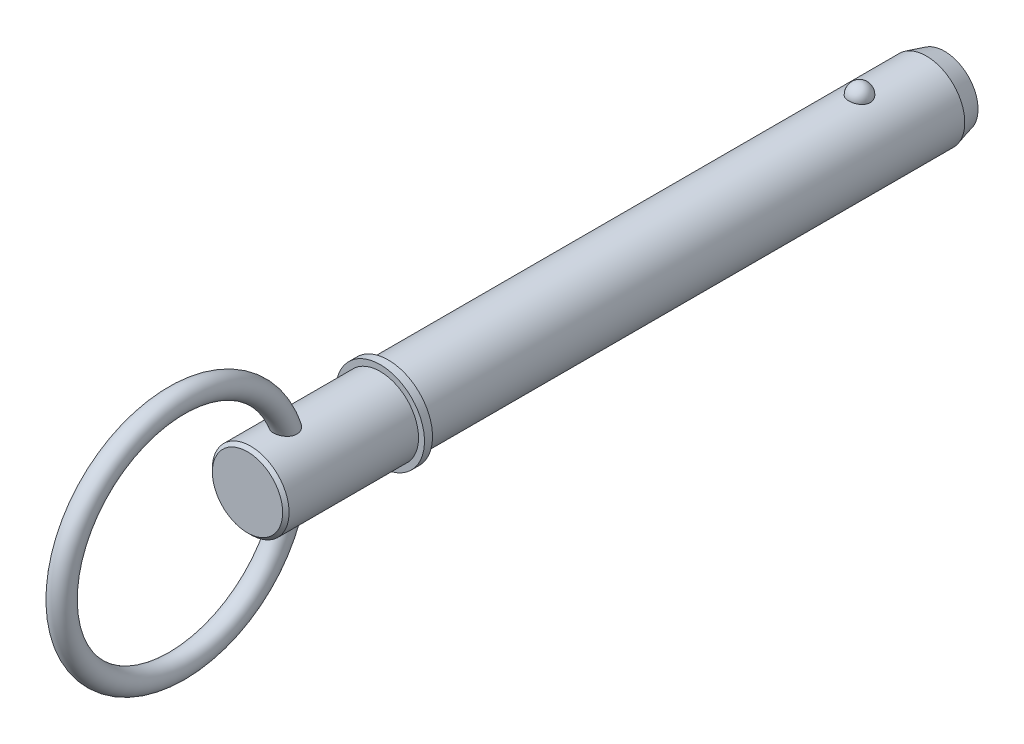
ISO-10303-21;
HEADER;
FILE_DESCRIPTION(('STEP AP214'),'2;1');
FILE_NAME('part.step','',(''),(''),'','','');
FILE_SCHEMA(('AUTOMOTIVE_DESIGN { 1 0 10303 214 1 1 1 1 }'));
ENDSEC;
DATA;
#1=APPLICATION_CONTEXT('core data for automotive mechanical design processes');
#2=APPLICATION_PROTOCOL_DEFINITION('international standard','automotive_design',2000,#1);
#3=PRODUCT_CONTEXT('',#1,'mechanical');
#4=PRODUCT('Part','Part','',(#3));
#5=PRODUCT_RELATED_PRODUCT_CATEGORY('part','',(#4));
#6=PRODUCT_DEFINITION_FORMATION('','',#4);
#7=PRODUCT_DEFINITION_CONTEXT('part definition',#1,'design');
#8=PRODUCT_DEFINITION('design','',#6,#7);
#9=PRODUCT_DEFINITION_SHAPE('','',#8);
#10=(LENGTH_UNIT() NAMED_UNIT(*) SI_UNIT(.MILLI.,.METRE.));
#11=(NAMED_UNIT(*) PLANE_ANGLE_UNIT() SI_UNIT($,.RADIAN.));
#12=(NAMED_UNIT(*) SI_UNIT($,.STERADIAN.) SOLID_ANGLE_UNIT());
#13=UNCERTAINTY_MEASURE_WITH_UNIT(LENGTH_MEASURE(1.E-05),#10,'distance_accuracy_value','');
#14=(GEOMETRIC_REPRESENTATION_CONTEXT(3) GLOBAL_UNCERTAINTY_ASSIGNED_CONTEXT((#13)) GLOBAL_UNIT_ASSIGNED_CONTEXT((#10,
#11,#12)) REPRESENTATION_CONTEXT('',''));
#15=CARTESIAN_POINT('',(0.,0.,0.));
#16=DIRECTION('',(0.,0.,1.));
#17=DIRECTION('',(1.,0.,0.));
#18=AXIS2_PLACEMENT_3D('',#15,#16,#17);
#19=CARTESIAN_POINT('',(0.,0.,114.3));
#20=DIRECTION('',(0.,0.,-1.));
#21=DIRECTION('',(-1.,0.,0.));
#22=AXIS2_PLACEMENT_3D('',#19,#20,#21);
#23=CYLINDRICAL_SURFACE('',#22,9.525);
#24=CARTESIAN_POINT('',(2.66304631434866,9.14515223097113,-2.68999999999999));
#25=CARTESIAN_POINT('',(2.66304388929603,9.14515434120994,-2.53964785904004));
#26=CARTESIAN_POINT('',(2.65079171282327,9.14874785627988,-2.38926509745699));
#27=CARTESIAN_POINT('',(2.60207590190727,9.16272073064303,-2.09276319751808));
#28=CARTESIAN_POINT('',(2.5656035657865,9.17310252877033,-1.94664561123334));
#29=CARTESIAN_POINT('',(2.469373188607,9.19947238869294,-1.66290124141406));
#30=CARTESIAN_POINT('',(2.40962536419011,9.215457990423,-1.52527076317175));
#31=CARTESIAN_POINT('',(2.26832639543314,9.25124900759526,-1.26225231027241));
#32=CARTESIAN_POINT('',(2.1867756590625,9.27105435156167,-1.13686410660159));
#33=CARTESIAN_POINT('',(2.00344089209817,9.3123948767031,-0.901158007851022));
#34=CARTESIAN_POINT('',(1.90155748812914,9.33393823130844,-0.790918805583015));
#35=CARTESIAN_POINT('',(1.68043702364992,9.37626794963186,-0.589299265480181));
#36=CARTESIAN_POINT('',(1.56119995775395,9.397054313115,-0.497918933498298));
#37=CARTESIAN_POINT('',(1.30893044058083,9.43549335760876,-0.336812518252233));
#38=CARTESIAN_POINT('',(1.17593917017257,9.45315498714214,-0.267024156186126));
#39=CARTESIAN_POINT('',(0.8995966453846,9.48344056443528,-0.150749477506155));
#40=CARTESIAN_POINT('',(0.756246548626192,9.49606507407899,-0.104260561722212));
#41=CARTESIAN_POINT('',(0.466048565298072,9.51468193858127,-0.0365733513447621));
#42=CARTESIAN_POINT('',(0.319312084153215,9.52079100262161,-0.014929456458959));
#43=CARTESIAN_POINT('',(0.0241592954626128,9.52611235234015,0.00395337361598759));
#44=CARTESIAN_POINT('',(-0.124256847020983,9.5253253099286,0.00119468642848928));
#45=CARTESIAN_POINT('',(-0.41628168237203,9.51700443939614,-0.0284230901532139));
#46=CARTESIAN_POINT('',(-0.559928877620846,9.50956858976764,-0.0549321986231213));
#47=CARTESIAN_POINT('',(-0.840604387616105,9.48887888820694,-0.130816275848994));
#48=CARTESIAN_POINT('',(-0.977632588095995,9.47562493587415,-0.180191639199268));
#49=CARTESIAN_POINT('',(-1.24212223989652,9.44460733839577,-0.300803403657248));
#50=CARTESIAN_POINT('',(-1.36952298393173,9.42681774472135,-0.372166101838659));
#51=CARTESIAN_POINT('',(-1.61053183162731,9.38864858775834,-0.534729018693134));
#52=CARTESIAN_POINT('',(-1.72413851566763,9.36826875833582,-0.625931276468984));
#53=CARTESIAN_POINT('',(-1.9367483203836,9.32666137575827,-0.827716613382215));
#54=CARTESIAN_POINT('',(-2.03542624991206,9.3054250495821,-0.938640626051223));
#55=CARTESIAN_POINT('',(-2.21301001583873,9.26480083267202,-1.17562728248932));
#56=CARTESIAN_POINT('',(-2.29191442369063,9.24541307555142,-1.3016910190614));
#57=CARTESIAN_POINT('',(-2.4288038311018,9.21040769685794,-1.56709947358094));
#58=CARTESIAN_POINT('',(-2.48653332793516,9.19483682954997,-1.70658229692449));
#59=CARTESIAN_POINT('',(-2.57830950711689,9.16952722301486,-1.99363485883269));
#60=CARTESIAN_POINT('',(-2.61235688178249,9.1597883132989,-2.14120436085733));
#61=CARTESIAN_POINT('',(-2.65582131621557,9.14728131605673,-2.43957517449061));
#62=CARTESIAN_POINT('',(-2.66534248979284,9.14448376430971,-2.59036007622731));
#63=CARTESIAN_POINT('',(-2.659816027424,9.1460926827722,-2.89143694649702));
#64=CARTESIAN_POINT('',(-2.64476907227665,9.15049895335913,-3.04172892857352));
#65=CARTESIAN_POINT('',(-2.59062526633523,9.16597303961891,-3.3367616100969));
#66=CARTESIAN_POINT('',(-2.55165119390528,9.17700684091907,-3.48152666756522));
#67=CARTESIAN_POINT('',(-2.45072334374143,9.20447158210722,-3.7622672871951));
#68=CARTESIAN_POINT('',(-2.38876863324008,9.22090274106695,-3.89824249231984));
#69=CARTESIAN_POINT('',(-2.24300082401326,9.25744165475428,-4.15838266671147));
#70=CARTESIAN_POINT('',(-2.15906901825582,9.27756919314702,-4.28247834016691));
#71=CARTESIAN_POINT('',(-1.97161008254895,9.31920445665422,-4.51460755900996));
#72=CARTESIAN_POINT('',(-1.86808218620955,9.34071223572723,-4.62264047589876));
#73=CARTESIAN_POINT('',(-1.64365852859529,9.38280712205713,-4.82005417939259));
#74=CARTESIAN_POINT('',(-1.52269814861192,9.40339041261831,-4.90936239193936));
#75=CARTESIAN_POINT('',(-1.26696810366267,9.44124442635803,-5.06628635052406));
#76=CARTESIAN_POINT('',(-1.13219941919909,9.45851538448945,-5.13390363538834));
#77=CARTESIAN_POINT('',(-0.854427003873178,9.48761400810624,-5.24478918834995));
#78=CARTESIAN_POINT('',(-0.711548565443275,9.49950757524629,-5.28835378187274));
#79=CARTESIAN_POINT('',(-0.420167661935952,9.51684639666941,-5.35116010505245));
#80=CARTESIAN_POINT('',(-0.271665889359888,9.52229244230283,-5.3704048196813));
#81=CARTESIAN_POINT('',(0.0236961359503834,9.52609381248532,-5.38387805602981));
#82=CARTESIAN_POINT('',(0.170533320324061,9.52458300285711,-5.37857884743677));
#83=CARTESIAN_POINT('',(0.461166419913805,9.51494050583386,-5.34419624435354));
#84=CARTESIAN_POINT('',(0.604962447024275,9.50680906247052,-5.31511372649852));
#85=CARTESIAN_POINT('',(0.884899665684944,9.48484202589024,-5.23415185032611));
#86=CARTESIAN_POINT('',(1.02106863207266,9.47102889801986,-5.18236222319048));
#87=CARTESIAN_POINT('',(1.28268503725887,9.43915933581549,-5.05742910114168));
#88=CARTESIAN_POINT('',(1.40813178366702,9.421102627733,-4.98428422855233));
#89=CARTESIAN_POINT('',(1.64690915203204,9.38233399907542,-4.8172920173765));
#90=CARTESIAN_POINT('',(1.76002050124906,9.36158508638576,-4.72313982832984));
#91=CARTESIAN_POINT('',(1.96897358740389,9.31987907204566,-4.51732444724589));
#92=CARTESIAN_POINT('',(2.06481234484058,9.29892193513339,-4.40565824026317));
#93=CARTESIAN_POINT('',(2.23837433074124,9.25869342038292,-4.16566572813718));
#94=CARTESIAN_POINT('',(2.31574652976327,9.23945848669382,-4.03707931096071));
#95=CARTESIAN_POINT('',(2.44818540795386,9.20525491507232,-3.76840633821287));
#96=CARTESIAN_POINT('',(2.50325979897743,9.19028480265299,-3.6283237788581));
#97=CARTESIAN_POINT('',(2.58510224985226,9.16757716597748,-3.35610038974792));
#98=CARTESIAN_POINT('',(2.61427951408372,9.15923447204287,-3.2247283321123));
#99=CARTESIAN_POINT('',(2.6532524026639,9.14802112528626,-2.95891229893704));
#100=CARTESIAN_POINT('',(2.66304848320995,9.1451503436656,-2.82446839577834));
#101=CARTESIAN_POINT('',(2.66304631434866,9.14515223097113,-2.68999999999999));
#102=B_SPLINE_CURVE_WITH_KNOTS('',3,(#24,#25,#26,#27,#28,#29,#30,#31,#32,#33,#34,#35,#36,#37,
#38,#39,#40,#41,#42,#43,#44,#45,#46,#47,#48,#49,#50,#51,#52,#53,#54,#55,#56,#57,#58,#59,#60,#61,
#62,#63,#64,#65,#66,#67,#68,#69,#70,#71,#72,#73,#74,#75,#76,#77,#78,#79,#80,#81,#82,#83,#84,#85,
#86,#87,#88,#89,#90,#91,#92,#93,#94,#95,#96,#97,#98,#99,#100,#101),.UNSPECIFIED.,.T.,.F.,(4,2,2,
2,2,2,2,2,2,2,2,2,2,2,2,2,2,2,2,2,2,2,2,2,2,2,2,2,2,2,2,2,2,2,2,2,2,2,4),(0.,0.450573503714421,
0.901308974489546,1.35184682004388,1.80237623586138,2.25516399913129,2.70795190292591,
3.15942136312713,3.61084044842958,4.0540301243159,4.49717661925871,4.9338984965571,
5.37062791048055,5.80991423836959,6.24924573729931,6.69708004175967,7.1449466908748,
7.5980522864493,8.0511446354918,8.50231041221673,8.95346368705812,9.40232106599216,
9.85119666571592,10.3025487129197,10.7539184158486,11.2070064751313,11.6600623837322,
12.1074045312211,12.5546917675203,12.9934085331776,13.4321091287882,13.8690915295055,
14.3061021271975,14.7499227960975,15.1938199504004,15.6455814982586,16.0971866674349,
16.5001694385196,16.9031427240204),.UNSPECIFIED.);
#103=CARTESIAN_POINT('',(2.66304631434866,9.14515223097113,-2.68999999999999));
#104=VERTEX_POINT('',#103);
#105=EDGE_CURVE('E102',#104,#104,#102,.T.);
#106=ORIENTED_EDGE('',*,*,#105,.T.);
#107=EDGE_LOOP('',(#106));
#108=FACE_BOUND('',#107,.T.);
#109=CARTESIAN_POINT('',(0.,0.,-19.2999999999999));
#110=DIRECTION('',(0.,0.,-1.));
#111=DIRECTION('',(-1.,0.,0.));
#112=AXIS2_PLACEMENT_3D('',#109,#110,#111);
#113=CIRCLE('',#112,9.525);
#114=CARTESIAN_POINT('',(-9.525,0.,-19.2999999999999));
#115=VERTEX_POINT('',#114);
#116=EDGE_CURVE('E109',#115,#115,#113,.F.);
#117=ORIENTED_EDGE('',*,*,#116,.T.);
#118=EDGE_LOOP('',(#117));
#119=FACE_BOUND('',#118,.T.);
#120=CARTESIAN_POINT('',(0.,0.,114.3));
#121=DIRECTION('',(0.,0.,1.));
#122=DIRECTION('',(1.,0.,0.));
#123=AXIS2_PLACEMENT_3D('',#120,#121,#122);
#124=CIRCLE('',#123,9.525);
#125=CARTESIAN_POINT('',(9.525,0.,114.3));
#126=VERTEX_POINT('',#125);
#127=EDGE_CURVE('E107',#126,#126,#124,.T.);
#128=ORIENTED_EDGE('',*,*,#127,.F.);
#129=EDGE_LOOP('',(#128));
#130=FACE_BOUND('',#129,.T.);
#131=ADVANCED_FACE('F39',(#108,#119,#130),#23,.T.);
#132=CARTESIAN_POINT('',(0.,0.,-23.8));
#133=DIRECTION('',(0.,0.,-1.));
#134=DIRECTION('',(-1.,0.,0.));
#135=AXIS2_PLACEMENT_3D('',#132,#133,#134);
#136=PLANE('',#135);
#137=CARTESIAN_POINT('',(0.,0.,-23.8));
#138=DIRECTION('',(0.,0.,-1.));
#139=DIRECTION('',(-1.,0.,0.));
#140=AXIS2_PLACEMENT_3D('',#137,#138,#139);
#141=CIRCLE('',#140,8.31922863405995);
#142=CARTESIAN_POINT('',(-8.31922863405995,0.,-23.8));
#143=VERTEX_POINT('',#142);
#144=EDGE_CURVE('E142',#143,#143,#141,.T.);
#145=ORIENTED_EDGE('',*,*,#144,.T.);
#146=EDGE_LOOP('',(#145));
#147=FACE_BOUND('',#146,.T.);
#148=ADVANCED_FACE('F88',(#147),#136,.T.);
#149=CARTESIAN_POINT('',(0.,0.,-23.8));
#150=DIRECTION('',(0.,0.,1.));
#151=DIRECTION('',(1.,0.,0.));
#152=AXIS2_PLACEMENT_3D('',#149,#150,#151);
#153=CONICAL_SURFACE('',#152,8.31922863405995,0.261799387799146);
#154=ORIENTED_EDGE('',*,*,#116,.F.);
#155=EDGE_LOOP('',(#154));
#156=FACE_BOUND('',#155,.T.);
#157=ORIENTED_EDGE('',*,*,#144,.F.);
#158=EDGE_LOOP('',(#157));
#159=FACE_BOUND('',#158,.T.);
#160=ADVANCED_FACE('F94',(#156,#159),#153,.T.);
#161=CARTESIAN_POINT('',(0.,9.525,-2.68999999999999));
#162=DIRECTION('',(0.,1.,0.));
#163=DIRECTION('',(0.,0.,1.));
#164=AXIS2_PLACEMENT_3D('',#161,#162,#163);
#165=SPHERICAL_SURFACE('',#164,2.69);
#166=ORIENTED_EDGE('',*,*,#105,.F.);
#167=EDGE_LOOP('',(#166));
#168=FACE_BOUND('',#167,.T.);
#169=ADVANCED_FACE('F112',(#168),#165,.T.);
#170=CARTESIAN_POINT('',(0.,0.,114.3));
#171=DIRECTION('',(0.,0.,-1.));
#172=DIRECTION('',(-1.,0.,0.));
#173=AXIS2_PLACEMENT_3D('',#170,#171,#172);
#174=PLANE('',#173);
#175=ORIENTED_EDGE('',*,*,#127,.T.);
#176=EDGE_LOOP('',(#175));
#177=FACE_BOUND('',#176,.T.);
#178=CARTESIAN_POINT('',(0.,0.,114.3));
#179=DIRECTION('',(0.,0.,-1.));
#180=DIRECTION('',(-1.,0.,0.));
#181=AXIS2_PLACEMENT_3D('',#178,#179,#180);
#182=CIRCLE('',#181,11.);
#183=CARTESIAN_POINT('',(-11.,0.,114.3));
#184=VERTEX_POINT('',#183);
#185=EDGE_CURVE('E108',#184,#184,#182,.T.);
#186=ORIENTED_EDGE('',*,*,#185,.T.);
#187=EDGE_LOOP('',(#186));
#188=FACE_BOUND('',#187,.T.);
#189=ADVANCED_FACE('F116',(#177,#188),#174,.T.);
#190=CARTESIAN_POINT('',(0.,0.,33.7287874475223));
#191=DIRECTION('',(0.,0.,-1.));
#192=DIRECTION('',(-1.,0.,0.));
#193=AXIS2_PLACEMENT_3D('',#190,#191,#192);
#194=CYLINDRICAL_SURFACE('',#193,11.);
#195=CARTESIAN_POINT('',(0.,0.,116.3));
#196=DIRECTION('',(0.,0.,-1.));
#197=DIRECTION('',(-1.,0.,0.));
#198=AXIS2_PLACEMENT_3D('',#195,#196,#197);
#199=CIRCLE('',#198,11.);
#200=CARTESIAN_POINT('',(-11.,0.,116.3));
#201=VERTEX_POINT('',#200);
#202=EDGE_CURVE('E133',#201,#201,#199,.T.);
#203=ORIENTED_EDGE('',*,*,#202,.T.);
#204=EDGE_LOOP('',(#203));
#205=FACE_BOUND('',#204,.T.);
#206=ORIENTED_EDGE('',*,*,#185,.F.);
#207=EDGE_LOOP('',(#206));
#208=FACE_BOUND('',#207,.T.);
#209=ADVANCED_FACE('F120',(#205,#208),#194,.T.);
#210=CARTESIAN_POINT('',(0.,11.,116.3));
#211=DIRECTION('',(0.,0.,1.));
#212=DIRECTION('',(1.,0.,0.));
#213=AXIS2_PLACEMENT_3D('',#210,#211,#212);
#214=PLANE('',#213);
#215=CARTESIAN_POINT('',(0.,0.,116.3));
#216=DIRECTION('',(0.,0.,1.));
#217=DIRECTION('',(1.,0.,0.));
#218=AXIS2_PLACEMENT_3D('',#215,#216,#217);
#219=CIRCLE('',#218,9.525);
#220=CARTESIAN_POINT('',(9.525,0.,116.3));
#221=VERTEX_POINT('',#220);
#222=EDGE_CURVE('E111',#221,#221,#219,.T.);
#223=ORIENTED_EDGE('',*,*,#222,.F.);
#224=EDGE_LOOP('',(#223));
#225=FACE_BOUND('',#224,.T.);
#226=ORIENTED_EDGE('',*,*,#202,.F.);
#227=EDGE_LOOP('',(#226));
#228=FACE_BOUND('',#227,.T.);
#229=ADVANCED_FACE('F85',(#225,#228),#214,.T.);
#230=CARTESIAN_POINT('',(0.,0.,149.23));
#231=DIRECTION('',(0.,0.,-1.));
#232=DIRECTION('',(-1.,0.,0.));
#233=AXIS2_PLACEMENT_3D('',#230,#231,#232);
#234=CYLINDRICAL_SURFACE('',#233,9.525);
#235=CARTESIAN_POINT('',(-1.1725502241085,-9.45255262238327,137.215681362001));
#236=CARTESIAN_POINT('',(-1.03279041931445,-9.46988901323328,137.152058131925));
#237=CARTESIAN_POINT('',(-0.887457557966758,-9.48474288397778,137.100036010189));
#238=CARTESIAN_POINT('',(-0.589790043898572,-9.50789357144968,137.020301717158));
#239=CARTESIAN_POINT('',(-0.437456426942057,-9.51619135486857,136.992585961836));
#240=CARTESIAN_POINT('',(-0.130095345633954,-9.52535230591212,136.962037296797));
#241=CARTESIAN_POINT('',(0.0249321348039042,-9.52621542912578,136.959204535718));
#242=CARTESIAN_POINT('',(0.333291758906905,-9.5204161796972,136.978480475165));
#243=CARTESIAN_POINT('',(0.486623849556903,-9.51375357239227,137.000589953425));
#244=CARTESIAN_POINT('',(0.787326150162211,-9.49360162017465,137.069309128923));
#245=CARTESIAN_POINT('',(0.934692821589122,-9.48010828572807,137.115933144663));
#246=CARTESIAN_POINT('',(1.21917062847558,-9.44773819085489,137.232695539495));
#247=CARTESIAN_POINT('',(1.3562816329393,-9.42886136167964,137.302834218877));
#248=CARTESIAN_POINT('',(1.61597534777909,-9.38783836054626,137.464858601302));
#249=CARTESIAN_POINT('',(1.7385930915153,-9.36570037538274,137.556690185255));
#250=CARTESIAN_POINT('',(1.96611924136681,-9.32059424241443,137.759983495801));
#251=CARTESIAN_POINT('',(2.07103000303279,-9.29762620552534,137.871442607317));
#252=CARTESIAN_POINT('',(2.25895856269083,-9.25375378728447,138.109567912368));
#253=CARTESIAN_POINT('',(2.3422308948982,-9.23282741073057,138.236029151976));
#254=CARTESIAN_POINT('',(2.48638570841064,-9.19505802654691,138.501654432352));
#255=CARTESIAN_POINT('',(2.54727152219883,-9.17821441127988,138.640816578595));
#256=CARTESIAN_POINT('',(2.64504150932,-9.15051673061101,138.926450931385));
#257=CARTESIAN_POINT('',(2.68213620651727,-9.13961026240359,139.07284631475));
#258=CARTESIAN_POINT('',(2.73308631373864,-9.1245038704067,139.369935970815));
#259=CARTESIAN_POINT('',(2.74693762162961,-9.12030513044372,139.520630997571));
#260=CARTESIAN_POINT('',(2.75225289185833,-9.11870262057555,139.828204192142));
#261=CARTESIAN_POINT('',(2.742835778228,-9.12156626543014,139.985097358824));
#262=CARTESIAN_POINT('',(2.70120500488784,-9.1339786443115,140.295530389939));
#263=CARTESIAN_POINT('',(2.6689831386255,-9.14352978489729,140.449069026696));
#264=CARTESIAN_POINT('',(2.57915721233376,-9.1692947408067,140.764317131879));
#265=CARTESIAN_POINT('',(2.51938387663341,-9.18606757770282,140.92536274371));
#266=CARTESIAN_POINT('',(2.37615490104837,-9.22415241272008,141.236112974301));
#267=CARTESIAN_POINT('',(2.2926764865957,-9.2454687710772,141.385806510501));
#268=CARTESIAN_POINT('',(2.09570343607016,-9.29218719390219,141.682005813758));
#269=CARTESIAN_POINT('',(1.98029238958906,-9.3177815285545,141.827215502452));
#270=CARTESIAN_POINT('',(1.72523060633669,-9.36835235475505,142.094631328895));
#271=CARTESIAN_POINT('',(1.58560973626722,-9.39332956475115,142.21686542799));
#272=CARTESIAN_POINT('',(1.31999418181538,-9.43381163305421,142.406542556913));
#273=CARTESIAN_POINT('',(1.19849876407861,-9.45016352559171,142.480111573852));
#274=CARTESIAN_POINT('',(0.944726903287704,-9.47889043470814,142.606555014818));
#275=CARTESIAN_POINT('',(0.812460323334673,-9.4912690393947,142.65944811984));
#276=CARTESIAN_POINT('',(0.539385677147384,-9.51070487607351,142.741579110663));
#277=CARTESIAN_POINT('',(0.398529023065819,-9.51772807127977,142.770665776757));
#278=CARTESIAN_POINT('',(0.113692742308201,-9.52538430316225,142.80234627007));
#279=CARTESIAN_POINT('',(-0.0302854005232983,-9.52602031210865,142.804952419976));
#280=CARTESIAN_POINT('',(-0.301067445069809,-9.52110324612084,142.784638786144));
#281=CARTESIAN_POINT('',(-0.428091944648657,-9.51619084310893,142.764361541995));
#282=CARTESIAN_POINT('',(-0.676960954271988,-9.50173118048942,142.703770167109));
#283=CARTESIAN_POINT('',(-0.79880468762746,-9.49218322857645,142.663453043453));
#284=CARTESIAN_POINT('',(-1.03743276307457,-9.4691126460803,142.563797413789));
#285=CARTESIAN_POINT('',(-1.15402581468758,-9.45550022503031,142.504026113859));
#286=CARTESIAN_POINT('',(-1.37707059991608,-9.42560278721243,142.368465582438));
#287=CARTESIAN_POINT('',(-1.48351822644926,-9.40931669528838,142.292669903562));
#288=CARTESIAN_POINT('',(-1.70022776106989,-9.37276249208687,142.115206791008));
#289=CARTESIAN_POINT('',(-1.80866644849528,-9.35226352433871,142.011363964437));
#290=CARTESIAN_POINT('',(-2.00947431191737,-9.31118474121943,141.78916467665));
#291=CARTESIAN_POINT('',(-2.10183201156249,-9.29060487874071,141.670797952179));
#292=CARTESIAN_POINT('',(-2.28343646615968,-9.24779116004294,141.401723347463));
#293=CARTESIAN_POINT('',(-2.36963977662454,-9.22584708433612,141.248904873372));
#294=CARTESIAN_POINT('',(-2.51731958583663,-9.18665215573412,140.931108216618));
#295=CARTESIAN_POINT('',(-2.57878214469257,-9.16940395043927,140.766123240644));
#296=CARTESIAN_POINT('',(-2.67771284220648,-9.14102404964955,140.417906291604));
#297=CARTESIAN_POINT('',(-2.71355979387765,-9.13031106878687,140.234171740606));
#298=CARTESIAN_POINT('',(-2.75239325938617,-9.11868499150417,139.862939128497));
#299=CARTESIAN_POINT('',(-2.75540326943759,-9.11776488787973,139.675443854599));
#300=CARTESIAN_POINT('',(-2.72755769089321,-9.12612848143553,139.318233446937));
#301=CARTESIAN_POINT('',(-2.69938579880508,-9.1346036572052,139.148293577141));
#302=CARTESIAN_POINT('',(-2.6128234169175,-9.15973790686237,138.81694195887));
#303=CARTESIAN_POINT('',(-2.55445306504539,-9.17639152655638,138.655524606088));
#304=CARTESIAN_POINT('',(-2.41575064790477,-9.21381352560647,138.362262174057));
#305=CARTESIAN_POINT('',(-2.33810564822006,-9.23402440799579,138.229067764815));
#306=CARTESIAN_POINT('',(-2.1611059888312,-9.27704240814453,137.978436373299));
#307=CARTESIAN_POINT('',(-2.06174995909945,-9.29984968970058,137.86100038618));
#308=CARTESIAN_POINT('',(-1.84046167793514,-9.3462023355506,137.641444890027));
#309=CARTESIAN_POINT('',(-1.71787459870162,-9.36974632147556,137.53998498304));
#310=CARTESIAN_POINT('',(-1.45637301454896,-9.41393415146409,137.360085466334));
#311=CARTESIAN_POINT('',(-1.31745717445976,-9.43457775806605,137.281647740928));
#312=CARTESIAN_POINT('',(-1.1725502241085,-9.45255262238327,137.215681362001));
#313=B_SPLINE_CURVE_WITH_KNOTS('',3,(#235,#236,#237,#238,#239,#240,#241,#242,#243,#244,#245,
#246,#247,#248,#249,#250,#251,#252,#253,#254,#255,#256,#257,#258,#259,#260,#261,#262,#263,#264,
#265,#266,#267,#268,#269,#270,#271,#272,#273,#274,#275,#276,#277,#278,#279,#280,#281,#282,#283,
#284,#285,#286,#287,#288,#289,#290,#291,#292,#293,#294,#295,#296,#297,#298,#299,#300,#301,#302,
#303,#304,#305,#306,#307,#308,#309,#310,#311,#312),.UNSPECIFIED.,.T.,.F.,(4,2,2,2,2,2,2,2,2,2,2,
2,2,2,2,2,2,2,2,2,2,2,2,2,2,2,2,2,2,2,2,2,2,2,2,2,2,2,4),(0.,0.463035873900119,
0.926003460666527,1.38897381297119,1.85195860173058,2.31521411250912,2.77847553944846,
3.24059321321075,3.7026493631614,4.1589953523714,4.61527338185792,5.06745604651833,
5.51971850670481,5.98936669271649,6.45918397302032,6.97482863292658,7.49097038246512,
8.04995658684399,8.60825803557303,9.03545685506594,9.46226879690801,9.89177127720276,
10.3210738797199,10.7054535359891,11.0898906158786,11.4835430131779,11.877354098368,
12.3302409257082,12.7834496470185,13.3116493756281,13.8401462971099,14.3996817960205,
14.9588168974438,15.4733264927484,15.9874934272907,16.4516692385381,16.915874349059,
17.3959238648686,17.8760126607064),.UNSPECIFIED.);
#314=CARTESIAN_POINT('',(-1.1725502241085,-9.45255262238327,137.215681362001));
#315=VERTEX_POINT('',#314);
#316=EDGE_CURVE('E10',#315,#315,#313,.T.);
#317=ORIENTED_EDGE('',*,*,#316,.F.);
#318=EDGE_LOOP('',(#317));
#319=FACE_BOUND('',#318,.T.);
#320=CARTESIAN_POINT('',(-1.1725502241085,9.45255262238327,137.215681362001));
#321=CARTESIAN_POINT('',(-1.31058061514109,9.43543238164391,137.278514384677));
#322=CARTESIAN_POINT('',(-1.44315063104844,9.41589375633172,137.352651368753));
#323=CARTESIAN_POINT('',(-1.6936534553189,9.37407591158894,137.521892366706));
#324=CARTESIAN_POINT('',(-1.81158925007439,9.35179725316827,137.616992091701));
#325=CARTESIAN_POINT('',(-2.02956633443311,9.30692788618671,137.82596768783));
#326=CARTESIAN_POINT('',(-2.12959463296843,9.28433696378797,137.939857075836));
#327=CARTESIAN_POINT('',(-2.30883055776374,9.24139869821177,138.18334578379));
#328=CARTESIAN_POINT('',(-2.38804080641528,9.22105107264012,138.312943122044));
#329=CARTESIAN_POINT('',(-2.52289811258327,9.18506690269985,138.582637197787));
#330=CARTESIAN_POINT('',(-2.57879510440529,9.16938093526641,138.722602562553));
#331=CARTESIAN_POINT('',(-2.66732862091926,9.14402087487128,139.010194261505));
#332=CARTESIAN_POINT('',(-2.69996436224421,9.13434698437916,139.157820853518));
#333=CARTESIAN_POINT('',(-2.74234854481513,9.12171311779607,139.458709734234));
#334=CARTESIAN_POINT('',(-2.75176419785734,9.11885078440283,139.612022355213));
#335=CARTESIAN_POINT('',(-2.74768995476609,9.12007747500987,139.918282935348));
#336=CARTESIAN_POINT('',(-2.73419331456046,9.12416854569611,140.071230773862));
#337=CARTESIAN_POINT('',(-2.68381401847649,9.13911977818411,140.385048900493));
#338=CARTESIAN_POINT('',(-2.64520186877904,9.15047943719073,140.545615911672));
#339=CARTESIAN_POINT('',(-2.54485320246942,9.17889121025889,140.858878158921));
#340=CARTESIAN_POINT('',(-2.48309922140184,9.19594762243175,141.011567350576));
#341=CARTESIAN_POINT('',(-2.3305691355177,9.23584987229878,141.321122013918));
#342=CARTESIAN_POINT('',(-2.23745101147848,9.25911216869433,141.476784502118));
#343=CARTESIAN_POINT('',(-2.02674425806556,9.30750138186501,141.770279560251));
#344=CARTESIAN_POINT('',(-1.90916388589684,9.33262766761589,141.908118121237));
#345=CARTESIAN_POINT('',(-1.67044606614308,9.37804498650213,142.142015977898));
#346=CARTESIAN_POINT('',(-1.55243875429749,9.39849934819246,142.241240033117));
#347=CARTESIAN_POINT('',(-1.30125310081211,9.43654625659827,142.419193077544));
#348=CARTESIAN_POINT('',(-1.16808326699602,9.45414039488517,142.497933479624));
#349=CARTESIAN_POINT('',(-0.958516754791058,9.47691412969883,142.597606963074));
#350=CARTESIAN_POINT('',(-0.886649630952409,9.48392776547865,142.627860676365));
#351=CARTESIAN_POINT('',(-0.740281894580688,9.49647248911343,142.681484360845));
#352=CARTESIAN_POINT('',(-0.665782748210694,9.50200438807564,142.704858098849));
#353=CARTESIAN_POINT('',(-0.514804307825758,9.51137811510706,142.7442294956));
#354=CARTESIAN_POINT('',(-0.438326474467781,9.51522115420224,142.760232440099));
#355=CARTESIAN_POINT('',(-0.284116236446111,9.52107513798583,142.784532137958));
#356=CARTESIAN_POINT('',(-0.206384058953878,9.52308641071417,142.792830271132));
#357=CARTESIAN_POINT('',(0.00463957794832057,9.5259225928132,142.80454519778));
#358=CARTESIAN_POINT('',(0.138460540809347,9.52491109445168,142.800394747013));
#359=CARTESIAN_POINT('',(0.40315259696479,9.51738801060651,142.769251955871));
#360=CARTESIAN_POINT('',(0.534023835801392,9.51087669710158,142.742260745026));
#361=CARTESIAN_POINT('',(0.783985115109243,9.49347484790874,142.668806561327));
#362=CARTESIAN_POINT('',(0.903337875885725,9.48277338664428,142.623181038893));
#363=CARTESIAN_POINT('',(1.13363663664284,9.45800893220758,142.514928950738));
#364=CARTESIAN_POINT('',(1.24458027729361,9.44394500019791,142.452297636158));
#365=CARTESIAN_POINT('',(1.46880911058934,9.41182796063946,142.304389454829));
#366=CARTESIAN_POINT('',(1.58087386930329,9.39350137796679,142.217328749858));
#367=CARTESIAN_POINT('',(1.79132420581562,9.35565274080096,142.028247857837));
#368=CARTESIAN_POINT('',(1.88970126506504,9.33612995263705,141.926218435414));
#369=CARTESIAN_POINT('',(2.08778125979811,9.29401761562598,141.690997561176));
#370=CARTESIAN_POINT('',(2.18473298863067,9.27148591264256,141.55547341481));
#371=CARTESIAN_POINT('',(2.3573395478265,9.22911075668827,141.271030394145));
#372=CARTESIAN_POINT('',(2.43297838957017,9.20926932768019,141.122101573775));
#373=CARTESIAN_POINT('',(2.56843139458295,9.17247322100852,140.797269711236));
#374=CARTESIAN_POINT('',(2.62561924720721,9.15606955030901,140.620196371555));
#375=CARTESIAN_POINT('',(2.70930664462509,9.13166037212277,140.258330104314));
#376=CARTESIAN_POINT('',(2.73581406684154,9.12365270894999,140.073539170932));
#377=CARTESIAN_POINT('',(2.7551261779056,9.11784049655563,139.709017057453));
#378=CARTESIAN_POINT('',(2.74917791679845,9.11965839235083,139.529361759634));
#379=CARTESIAN_POINT('',(2.7047327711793,9.13294027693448,139.174499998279));
#380=CARTESIAN_POINT('',(2.66626406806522,9.14439591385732,138.999289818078));
#381=CARTESIAN_POINT('',(2.56263844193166,9.17393184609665,138.678469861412));
#382=CARTESIAN_POINT('',(2.50080069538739,9.19116614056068,138.531704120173));
#383=CARTESIAN_POINT('',(2.35244847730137,9.23024728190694,138.25189992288));
#384=CARTESIAN_POINT('',(2.26593972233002,9.25209305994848,138.118858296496));
#385=CARTESIAN_POINT('',(2.07585352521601,9.29652853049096,137.877145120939));
#386=CARTESIAN_POINT('',(1.97340753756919,9.31901931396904,137.767562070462));
#387=CARTESIAN_POINT('',(1.75142335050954,9.36327537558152,137.567179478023));
#388=CARTESIAN_POINT('',(1.63188535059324,9.3850406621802,137.476379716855));
#389=CARTESIAN_POINT('',(1.37826267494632,9.42563474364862,137.315168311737));
#390=CARTESIAN_POINT('',(1.24409194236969,9.44444438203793,137.244887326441));
#391=CARTESIAN_POINT('',(0.965562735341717,9.4769701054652,137.126996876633));
#392=CARTESIAN_POINT('',(0.821203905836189,9.49068601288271,137.079388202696));
#393=CARTESIAN_POINT('',(0.524366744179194,9.51173338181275,137.007369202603));
#394=CARTESIAN_POINT('',(0.371807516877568,9.5189799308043,136.983267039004));
#395=CARTESIAN_POINT('',(0.0646112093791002,9.52602042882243,136.959842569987));
#396=CARTESIAN_POINT('',(-0.0900262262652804,9.52581308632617,136.960524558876));
#397=CARTESIAN_POINT('',(-0.404139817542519,9.51777767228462,136.987276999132));
#398=CARTESIAN_POINT('',(-0.56350821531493,9.50959696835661,137.01452226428));
#399=CARTESIAN_POINT('',(-0.874799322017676,9.48602809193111,137.095533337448));
#400=CARTESIAN_POINT('',(-1.0267221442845,9.47064002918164,137.14929874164));
#401=CARTESIAN_POINT('',(-1.1725502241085,9.45255262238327,137.215681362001));
#402=B_SPLINE_CURVE_WITH_KNOTS('',3,(#320,#321,#322,#323,#324,#325,#326,#327,#328,#329,#330,
#331,#332,#333,#334,#335,#336,#337,#338,#339,#340,#341,#342,#343,#344,#345,#346,#347,#348,#349,
#350,#351,#352,#353,#354,#355,#356,#357,#358,#359,#360,#361,#362,#363,#364,#365,#366,#367,#368,
#369,#370,#371,#372,#373,#374,#375,#376,#377,#378,#379,#380,#381,#382,#383,#384,#385,#386,#387,
#388,#389,#390,#391,#392,#393,#394,#395,#396,#397,#398,#399,#400,#401),.UNSPECIFIED.,.T.,.F.,(4,
2,2,2,2,2,2,2,2,2,2,2,2,2,2,2,2,2,2,2,2,2,2,2,2,2,2,2,2,2,2,2,2,2,2,2,2,2,2,2,4),(0.,
0.457306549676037,0.914519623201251,1.37206305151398,1.82954881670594,2.28199545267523,
2.73445732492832,3.19336710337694,3.65241198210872,4.14699278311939,4.64194758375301,
5.18812269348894,5.734113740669,6.19889752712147,6.66342179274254,6.89799214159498,
7.13243382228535,7.3667071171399,7.60093844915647,8.0003243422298,8.3996904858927,
8.78279802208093,9.1660126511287,9.59366701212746,10.0215863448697,10.5240084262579,
11.0268064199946,11.5844522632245,12.1419548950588,12.6781910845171,13.213963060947,
13.6920531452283,14.1700325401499,14.6229745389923,15.0759112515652,15.5316722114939,
15.9874490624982,16.4491237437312,16.91087841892,17.3940267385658,17.8771677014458),.UNSPECIFIED.);
#403=CARTESIAN_POINT('',(-1.1725502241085,9.45255262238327,137.215681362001));
#404=VERTEX_POINT('',#403);
#405=EDGE_CURVE('E51',#404,#404,#402,.T.);
#406=ORIENTED_EDGE('',*,*,#405,.F.);
#407=EDGE_LOOP('',(#406));
#408=FACE_BOUND('',#407,.T.);
#409=CARTESIAN_POINT('',(0.,0.,148.43));
#410=DIRECTION('',(0.,0.,-1.));
#411=DIRECTION('',(-1.,0.,0.));
#412=AXIS2_PLACEMENT_3D('',#409,#410,#411);
#413=CIRCLE('',#412,9.525);
#414=CARTESIAN_POINT('',(-9.525,0.,148.43));
#415=VERTEX_POINT('',#414);
#416=EDGE_CURVE('E64',#415,#415,#413,.T.);
#417=ORIENTED_EDGE('',*,*,#416,.T.);
#418=EDGE_LOOP('',(#417));
#419=FACE_BOUND('',#418,.T.);
#420=ORIENTED_EDGE('',*,*,#222,.T.);
#421=EDGE_LOOP('',(#420));
#422=FACE_BOUND('',#421,.T.);
#423=ADVANCED_FACE('F69',(#319,#408,#419,#422),#234,.T.);
#424=CARTESIAN_POINT('',(0.,0.,149.23));
#425=DIRECTION('',(0.,0.,-1.));
#426=DIRECTION('',(-1.,0.,0.));
#427=AXIS2_PLACEMENT_3D('',#424,#425,#426);
#428=PLANE('',#427);
#429=CARTESIAN_POINT('',(0.,0.,149.23));
#430=DIRECTION('',(0.,0.,-1.));
#431=DIRECTION('',(-1.,0.,0.));
#432=AXIS2_PLACEMENT_3D('',#429,#430,#431);
#433=CIRCLE('',#432,8.72500000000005);
#434=CARTESIAN_POINT('',(-8.72500000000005,0.,149.23));
#435=VERTEX_POINT('',#434);
#436=EDGE_CURVE('E57',#435,#435,#433,.F.);
#437=ORIENTED_EDGE('',*,*,#436,.T.);
#438=EDGE_LOOP('',(#437));
#439=FACE_BOUND('',#438,.T.);
#440=ADVANCED_FACE('F76',(#439),#428,.F.);
#441=CARTESIAN_POINT('',(0.,0.,148.43));
#442=DIRECTION('',(0.,0.,-1.));
#443=DIRECTION('',(-1.,0.,0.));
#444=AXIS2_PLACEMENT_3D('',#441,#442,#443);
#445=CONICAL_SURFACE('',#444,9.525,0.785398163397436);
#446=ORIENTED_EDGE('',*,*,#436,.F.);
#447=EDGE_LOOP('',(#446));
#448=FACE_BOUND('',#447,.T.);
#449=ORIENTED_EDGE('',*,*,#416,.F.);
#450=EDGE_LOOP('',(#449));
#451=FACE_BOUND('',#450,.T.);
#452=ADVANCED_FACE('F41',(#448,#451),#445,.T.);
#453=CARTESIAN_POINT('',(0.,0.,166.805));
#454=DIRECTION('',(1.,0.,0.));
#455=DIRECTION('',(0.,0.,-1.));
#456=AXIS2_PLACEMENT_3D('',#453,#454,#455);
#457=TOROIDAL_SURFACE('',#456,28.575,2.75);
#458=ORIENTED_EDGE('',*,*,#316,.T.);
#459=EDGE_LOOP('',(#458));
#460=FACE_BOUND('',#459,.T.);
#461=ORIENTED_EDGE('',*,*,#405,.T.);
#462=EDGE_LOOP('',(#461));
#463=FACE_BOUND('',#462,.T.);
#464=ADVANCED_FACE('F73',(#460,#463),#457,.T.);
#465=CLOSED_SHELL('',(#131,#148,#160,#169,#189,#209,#229,#423,#440,#452,#464));
#466=MANIFOLD_SOLID_BREP('B2',#465);
#467=ADVANCED_BREP_SHAPE_REPRESENTATION('',(#18,#466),#14);
#468=SHAPE_DEFINITION_REPRESENTATION(#9,#467);
ENDSEC;
END-ISO-10303-21;
